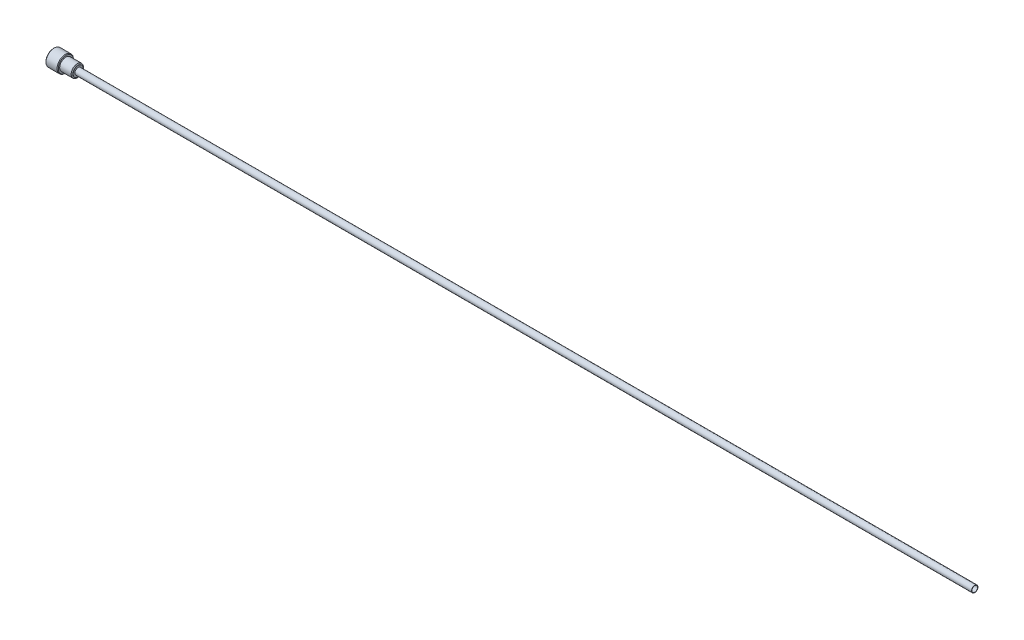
ISO-10303-21;
HEADER;
FILE_DESCRIPTION(('STEP AP214'),'2;1');
FILE_NAME('part.step','',(''),(''),'','','');
FILE_SCHEMA(('AUTOMOTIVE_DESIGN { 1 0 10303 214 1 1 1 1 }'));
ENDSEC;
DATA;
#1=APPLICATION_CONTEXT('core data for automotive mechanical design processes');
#2=APPLICATION_PROTOCOL_DEFINITION('international standard','automotive_design',2000,#1);
#3=PRODUCT_CONTEXT('',#1,'mechanical');
#4=PRODUCT('Part','Part','',(#3));
#5=PRODUCT_RELATED_PRODUCT_CATEGORY('part','',(#4));
#6=PRODUCT_DEFINITION_FORMATION('','',#4);
#7=PRODUCT_DEFINITION_CONTEXT('part definition',#1,'design');
#8=PRODUCT_DEFINITION('design','',#6,#7);
#9=PRODUCT_DEFINITION_SHAPE('','',#8);
#10=(LENGTH_UNIT() NAMED_UNIT(*) SI_UNIT(.MILLI.,.METRE.));
#11=(NAMED_UNIT(*) PLANE_ANGLE_UNIT() SI_UNIT($,.RADIAN.));
#12=(NAMED_UNIT(*) SI_UNIT($,.STERADIAN.) SOLID_ANGLE_UNIT());
#13=UNCERTAINTY_MEASURE_WITH_UNIT(LENGTH_MEASURE(1.E-05),#10,'distance_accuracy_value','');
#14=(GEOMETRIC_REPRESENTATION_CONTEXT(3) GLOBAL_UNCERTAINTY_ASSIGNED_CONTEXT((#13)) GLOBAL_UNIT_ASSIGNED_CONTEXT((#10,
#11,#12)) REPRESENTATION_CONTEXT('',''));
#15=CARTESIAN_POINT('',(0.,0.,0.));
#16=DIRECTION('',(0.,0.,1.));
#17=DIRECTION('',(1.,0.,0.));
#18=AXIS2_PLACEMENT_3D('',#15,#16,#17);
#19=CARTESIAN_POINT('',(12.,2.44,0.));
#20=DIRECTION('',(-1.,0.,0.));
#21=DIRECTION('',(0.,0.,1.));
#22=AXIS2_PLACEMENT_3D('',#19,#20,#21);
#23=PLANE('',#22);
#24=CARTESIAN_POINT('',(12.,0.,0.));
#25=DIRECTION('',(-1.,0.,0.));
#26=DIRECTION('',(0.,0.,1.));
#27=AXIS2_PLACEMENT_3D('',#24,#25,#26);
#28=CIRCLE('',#27,2.44);
#29=CARTESIAN_POINT('',(12.,0.,2.44));
#30=VERTEX_POINT('',#29);
#31=EDGE_CURVE('E133',#30,#30,#28,.T.);
#32=ORIENTED_EDGE('',*,*,#31,.F.);
#33=EDGE_LOOP('',(#32));
#34=FACE_BOUND('',#33,.T.);
#35=CARTESIAN_POINT('',(12.,0.,0.));
#36=DIRECTION('',(-1.,0.,0.));
#37=DIRECTION('',(0.,0.,1.));
#38=AXIS2_PLACEMENT_3D('',#35,#36,#37);
#39=CIRCLE('',#38,1.5875);
#40=CARTESIAN_POINT('',(12.,0.,1.5875));
#41=VERTEX_POINT('',#40);
#42=EDGE_CURVE('E115',#41,#41,#39,.T.);
#43=ORIENTED_EDGE('',*,*,#42,.T.);
#44=EDGE_LOOP('',(#43));
#45=FACE_BOUND('',#44,.T.);
#46=ADVANCED_FACE('F33',(#34,#45),#23,.F.);
#47=CARTESIAN_POINT('',(-22.2121854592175,0.,0.));
#48=DIRECTION('',(-1.,0.,0.));
#49=DIRECTION('',(0.,0.,1.));
#50=AXIS2_PLACEMENT_3D('',#47,#48,#49);
#51=CYLINDRICAL_SURFACE('',#50,2.44);
#52=CARTESIAN_POINT('',(11.9,0.,0.));
#53=DIRECTION('',(-1.,0.,0.));
#54=DIRECTION('',(0.,0.,1.));
#55=AXIS2_PLACEMENT_3D('',#52,#53,#54);
#56=CIRCLE('',#55,2.44);
#57=CARTESIAN_POINT('',(11.9,0.,2.44));
#58=VERTEX_POINT('',#57);
#59=EDGE_CURVE('E130',#58,#58,#56,.T.);
#60=ORIENTED_EDGE('',*,*,#59,.F.);
#61=EDGE_LOOP('',(#60));
#62=FACE_BOUND('',#61,.T.);
#63=ORIENTED_EDGE('',*,*,#31,.T.);
#64=EDGE_LOOP('',(#63));
#65=FACE_BOUND('',#64,.T.);
#66=ADVANCED_FACE('F272',(#62,#65),#51,.T.);
#67=CARTESIAN_POINT('',(11.9,0.,0.));
#68=DIRECTION('',(-1.,0.,0.));
#69=DIRECTION('',(0.,0.,1.));
#70=AXIS2_PLACEMENT_3D('',#67,#68,#69);
#71=CONICAL_SURFACE('',#70,2.44,1.0471975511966);
#72=CARTESIAN_POINT('',(11.5766838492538,0.,0.));
#73=DIRECTION('',(-1.,0.,0.));
#74=DIRECTION('',(0.,0.,1.));
#75=AXIS2_PLACEMENT_3D('',#72,#73,#74);
#76=CIRCLE('',#75,3.);
#77=CARTESIAN_POINT('',(11.5766838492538,0.,3.));
#78=VERTEX_POINT('',#77);
#79=EDGE_CURVE('E127',#78,#78,#76,.T.);
#80=ORIENTED_EDGE('',*,*,#79,.F.);
#81=EDGE_LOOP('',(#80));
#82=FACE_BOUND('',#81,.T.);
#83=ORIENTED_EDGE('',*,*,#59,.T.);
#84=EDGE_LOOP('',(#83));
#85=FACE_BOUND('',#84,.T.);
#86=ADVANCED_FACE('F278',(#82,#85),#71,.T.);
#87=CARTESIAN_POINT('',(-22.2121854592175,0.,0.));
#88=DIRECTION('',(-1.,0.,0.));
#89=DIRECTION('',(0.,0.,1.));
#90=AXIS2_PLACEMENT_3D('',#87,#88,#89);
#91=CYLINDRICAL_SURFACE('',#90,3.);
#92=CARTESIAN_POINT('',(6.,0.,0.));
#93=DIRECTION('',(-1.,0.,0.));
#94=DIRECTION('',(0.,0.,1.));
#95=AXIS2_PLACEMENT_3D('',#92,#93,#94);
#96=CIRCLE('',#95,3.);
#97=CARTESIAN_POINT('',(6.,0.,3.));
#98=VERTEX_POINT('',#97);
#99=EDGE_CURVE('E124',#98,#98,#96,.T.);
#100=ORIENTED_EDGE('',*,*,#99,.F.);
#101=EDGE_LOOP('',(#100));
#102=FACE_BOUND('',#101,.T.);
#103=ORIENTED_EDGE('',*,*,#79,.T.);
#104=EDGE_LOOP('',(#103));
#105=FACE_BOUND('',#104,.T.);
#106=ADVANCED_FACE('F286',(#102,#105),#91,.T.);
#107=CARTESIAN_POINT('',(6.,3.,0.));
#108=DIRECTION('',(-1.,0.,0.));
#109=DIRECTION('',(0.,0.,1.));
#110=AXIS2_PLACEMENT_3D('',#107,#108,#109);
#111=PLANE('',#110);
#112=CARTESIAN_POINT('',(6.,0.,0.));
#113=DIRECTION('',(-1.,0.,0.));
#114=DIRECTION('',(0.,0.,1.));
#115=AXIS2_PLACEMENT_3D('',#112,#113,#114);
#116=CIRCLE('',#115,3.69999999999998);
#117=CARTESIAN_POINT('',(6.,0.,3.69999999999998));
#118=VERTEX_POINT('',#117);
#119=EDGE_CURVE('E142',#118,#118,#116,.F.);
#120=ORIENTED_EDGE('',*,*,#119,.T.);
#121=EDGE_LOOP('',(#120));
#122=FACE_BOUND('',#121,.T.);
#123=ORIENTED_EDGE('',*,*,#99,.T.);
#124=EDGE_LOOP('',(#123));
#125=FACE_BOUND('',#124,.T.);
#126=ADVANCED_FACE('F290',(#122,#125),#111,.F.);
#127=CARTESIAN_POINT('',(-22.2121854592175,0.,0.));
#128=DIRECTION('',(-1.,0.,0.));
#129=DIRECTION('',(0.,0.,1.));
#130=AXIS2_PLACEMENT_3D('',#127,#128,#129);
#131=CYLINDRICAL_SURFACE('',#130,4.);
#132=CARTESIAN_POINT('',(5.69999999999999,0.,0.));
#133=DIRECTION('',(-1.,0.,0.));
#134=DIRECTION('',(0.,0.,1.));
#135=AXIS2_PLACEMENT_3D('',#132,#133,#134);
#136=CIRCLE('',#135,4.);
#137=CARTESIAN_POINT('',(5.69999999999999,0.,4.));
#138=VERTEX_POINT('',#137);
#139=EDGE_CURVE('E139',#138,#138,#136,.T.);
#140=ORIENTED_EDGE('',*,*,#139,.T.);
#141=EDGE_LOOP('',(#140));
#142=FACE_BOUND('',#141,.T.);
#143=CARTESIAN_POINT('',(0.299999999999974,0.,0.));
#144=DIRECTION('',(1.,0.,0.));
#145=DIRECTION('',(0.,0.,-1.));
#146=AXIS2_PLACEMENT_3D('',#143,#144,#145);
#147=CIRCLE('',#146,4.);
#148=CARTESIAN_POINT('',(0.299999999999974,0.,-4.));
#149=VERTEX_POINT('',#148);
#150=EDGE_CURVE('E136',#149,#149,#147,.T.);
#151=ORIENTED_EDGE('',*,*,#150,.T.);
#152=EDGE_LOOP('',(#151));
#153=FACE_BOUND('',#152,.T.);
#154=ADVANCED_FACE('F258',(#142,#153),#131,.T.);
#155=CARTESIAN_POINT('',(0.,1.3843,0.));
#156=DIRECTION('',(1.,0.,0.));
#157=DIRECTION('',(0.,0.,-1.));
#158=AXIS2_PLACEMENT_3D('',#155,#156,#157);
#159=PLANE('',#158);
#160=CARTESIAN_POINT('',(0.,0.,0.));
#161=DIRECTION('',(1.,0.,0.));
#162=DIRECTION('',(0.,0.,-1.));
#163=AXIS2_PLACEMENT_3D('',#160,#161,#162);
#164=CIRCLE('',#163,3.);
#165=CARTESIAN_POINT('',(0.,0.,-3.));
#166=VERTEX_POINT('',#165);
#167=EDGE_CURVE('E148',#166,#166,#164,.T.);
#168=ORIENTED_EDGE('',*,*,#167,.T.);
#169=EDGE_LOOP('',(#168));
#170=FACE_BOUND('',#169,.T.);
#171=CARTESIAN_POINT('',(0.,0.,0.));
#172=DIRECTION('',(1.,0.,0.));
#173=DIRECTION('',(0.,0.,-1.));
#174=AXIS2_PLACEMENT_3D('',#171,#172,#173);
#175=CIRCLE('',#174,3.70000000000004);
#176=CARTESIAN_POINT('',(0.,0.,-3.70000000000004));
#177=VERTEX_POINT('',#176);
#178=EDGE_CURVE('E145',#177,#177,#175,.F.);
#179=ORIENTED_EDGE('',*,*,#178,.T.);
#180=EDGE_LOOP('',(#179));
#181=FACE_BOUND('',#180,.T.);
#182=ADVANCED_FACE('F254',(#170,#181),#159,.F.);
#183=CARTESIAN_POINT('',(-22.2121854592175,0.,0.));
#184=DIRECTION('',(-1.,0.,0.));
#185=DIRECTION('',(0.,0.,1.));
#186=AXIS2_PLACEMENT_3D('',#183,#184,#185);
#187=CYLINDRICAL_SURFACE('',#186,1.38430000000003);
#188=CARTESIAN_POINT('',(4.47038019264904,0.,0.));
#189=DIRECTION('',(-1.,0.,0.));
#190=DIRECTION('',(0.,0.,1.));
#191=AXIS2_PLACEMENT_3D('',#188,#189,#190);
#192=CIRCLE('',#191,1.38430000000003);
#193=CARTESIAN_POINT('',(4.47038019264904,0.,1.38430000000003));
#194=VERTEX_POINT('',#193);
#195=EDGE_CURVE('E114',#194,#194,#192,.T.);
#196=ORIENTED_EDGE('',*,*,#195,.T.);
#197=EDGE_LOOP('',(#196));
#198=FACE_BOUND('',#197,.T.);
#199=CARTESIAN_POINT('',(450.,0.,0.));
#200=DIRECTION('',(-1.,0.,0.));
#201=DIRECTION('',(0.,0.,1.));
#202=AXIS2_PLACEMENT_3D('',#199,#200,#201);
#203=CIRCLE('',#202,1.38430000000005);
#204=CARTESIAN_POINT('',(450.,0.,1.38430000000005));
#205=VERTEX_POINT('',#204);
#206=EDGE_CURVE('E121',#205,#205,#203,.T.);
#207=ORIENTED_EDGE('',*,*,#206,.F.);
#208=EDGE_LOOP('',(#207));
#209=FACE_BOUND('',#208,.T.);
#210=ADVANCED_FACE('F257',(#198,#209),#187,.F.);
#211=CARTESIAN_POINT('',(450.,1.5875,0.));
#212=DIRECTION('',(-1.,0.,0.));
#213=DIRECTION('',(0.,0.,1.));
#214=AXIS2_PLACEMENT_3D('',#211,#212,#213);
#215=PLANE('',#214);
#216=CARTESIAN_POINT('',(450.,0.,0.));
#217=DIRECTION('',(-1.,0.,0.));
#218=DIRECTION('',(0.,0.,1.));
#219=AXIS2_PLACEMENT_3D('',#216,#217,#218);
#220=CIRCLE('',#219,1.5875);
#221=CARTESIAN_POINT('',(450.,0.,1.5875));
#222=VERTEX_POINT('',#221);
#223=EDGE_CURVE('E118',#222,#222,#220,.T.);
#224=ORIENTED_EDGE('',*,*,#223,.F.);
#225=EDGE_LOOP('',(#224));
#226=FACE_BOUND('',#225,.T.);
#227=ORIENTED_EDGE('',*,*,#206,.T.);
#228=EDGE_LOOP('',(#227));
#229=FACE_BOUND('',#228,.T.);
#230=ADVANCED_FACE('F299',(#226,#229),#215,.F.);
#231=CARTESIAN_POINT('',(-22.2121854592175,0.,0.));
#232=DIRECTION('',(-1.,0.,0.));
#233=DIRECTION('',(0.,0.,1.));
#234=AXIS2_PLACEMENT_3D('',#231,#232,#233);
#235=CYLINDRICAL_SURFACE('',#234,1.5875);
#236=ORIENTED_EDGE('',*,*,#42,.F.);
#237=EDGE_LOOP('',(#236));
#238=FACE_BOUND('',#237,.T.);
#239=ORIENTED_EDGE('',*,*,#223,.T.);
#240=EDGE_LOOP('',(#239));
#241=FACE_BOUND('',#240,.T.);
#242=ADVANCED_FACE('F195',(#238,#241),#235,.T.);
#243=CARTESIAN_POINT('',(5.69999999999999,0.,0.));
#244=DIRECTION('',(-1.,0.,0.));
#245=DIRECTION('',(0.,0.,1.));
#246=AXIS2_PLACEMENT_3D('',#243,#244,#245);
#247=CONICAL_SURFACE('',#246,4.,0.785398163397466);
#248=ORIENTED_EDGE('',*,*,#119,.F.);
#249=EDGE_LOOP('',(#248));
#250=FACE_BOUND('',#249,.T.);
#251=ORIENTED_EDGE('',*,*,#139,.F.);
#252=EDGE_LOOP('',(#251));
#253=FACE_BOUND('',#252,.T.);
#254=ADVANCED_FACE('F263',(#250,#253),#247,.T.);
#255=CARTESIAN_POINT('',(0.,0.,0.));
#256=DIRECTION('',(1.,0.,0.));
#257=DIRECTION('',(0.,0.,-1.));
#258=AXIS2_PLACEMENT_3D('',#255,#256,#257);
#259=CONICAL_SURFACE('',#258,3.70000000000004,0.785398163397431);
#260=CARTESIAN_POINT('',(0.299999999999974,0.,-4.));
#261=CARTESIAN_POINT('',(0.296874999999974,0.,-3.996875));
#262=CARTESIAN_POINT('',(0.293749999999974,0.,-3.99375));
#263=CARTESIAN_POINT('',(0.287499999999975,0.,-3.9875));
#264=CARTESIAN_POINT('',(0.284374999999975,0.,-3.984375));
#265=CARTESIAN_POINT('',(0.278124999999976,0.,-3.978125));
#266=CARTESIAN_POINT('',(0.274999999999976,0.,-3.975));
#267=CARTESIAN_POINT('',(0.268749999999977,0.,-3.96875));
#268=CARTESIAN_POINT('',(0.265624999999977,0.,-3.965625));
#269=CARTESIAN_POINT('',(0.259374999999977,0.,-3.959375));
#270=CARTESIAN_POINT('',(0.256249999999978,0.,-3.95625000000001));
#271=CARTESIAN_POINT('',(0.249999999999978,0.,-3.95000000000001));
#272=CARTESIAN_POINT('',(0.246874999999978,0.,-3.94687500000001));
#273=CARTESIAN_POINT('',(0.240624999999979,0.,-3.94062500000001));
#274=CARTESIAN_POINT('',(0.237499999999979,0.,-3.93750000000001));
#275=CARTESIAN_POINT('',(0.23124999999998,0.,-3.93125000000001));
#276=CARTESIAN_POINT('',(0.22812499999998,0.,-3.92812500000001));
#277=CARTESIAN_POINT('',(0.221874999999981,0.,-3.92187500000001));
#278=CARTESIAN_POINT('',(0.218749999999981,0.,-3.91875000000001));
#279=CARTESIAN_POINT('',(0.212499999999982,0.,-3.91250000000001));
#280=CARTESIAN_POINT('',(0.209374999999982,0.,-3.90937500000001));
#281=CARTESIAN_POINT('',(0.203124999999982,0.,-3.90312500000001));
#282=CARTESIAN_POINT('',(0.199999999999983,0.,-3.90000000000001));
#283=CARTESIAN_POINT('',(0.193749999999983,0.,-3.89375000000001));
#284=CARTESIAN_POINT('',(0.190624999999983,0.,-3.89062500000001));
#285=CARTESIAN_POINT('',(0.184374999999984,0.,-3.88437500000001));
#286=CARTESIAN_POINT('',(0.181249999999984,0.,-3.88125000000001));
#287=CARTESIAN_POINT('',(0.174999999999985,0.,-3.87500000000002));
#288=CARTESIAN_POINT('',(0.171874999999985,0.,-3.87187500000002));
#289=CARTESIAN_POINT('',(0.165624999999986,0.,-3.86562500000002));
#290=CARTESIAN_POINT('',(0.162499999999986,0.,-3.86250000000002));
#291=CARTESIAN_POINT('',(0.156249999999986,0.,-3.85625000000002));
#292=CARTESIAN_POINT('',(0.153124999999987,0.,-3.85312500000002));
#293=CARTESIAN_POINT('',(0.146874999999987,0.,-3.84687500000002));
#294=CARTESIAN_POINT('',(0.143749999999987,0.,-3.84375000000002));
#295=CARTESIAN_POINT('',(0.137499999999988,0.,-3.83750000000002));
#296=CARTESIAN_POINT('',(0.134374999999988,0.,-3.83437500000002));
#297=CARTESIAN_POINT('',(0.128124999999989,0.,-3.82812500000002));
#298=CARTESIAN_POINT('',(0.124999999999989,0.,-3.82500000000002));
#299=CARTESIAN_POINT('',(0.11874999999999,0.,-3.81875000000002));
#300=CARTESIAN_POINT('',(0.11562499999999,0.,-3.81562500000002));
#301=CARTESIAN_POINT('',(0.10937499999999,0.,-3.80937500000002));
#302=CARTESIAN_POINT('',(0.106249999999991,0.,-3.80625000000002));
#303=CARTESIAN_POINT('',(0.0999999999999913,0.,-3.80000000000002));
#304=CARTESIAN_POINT('',(0.0968749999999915,0.,-3.79687500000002));
#305=CARTESIAN_POINT('',(0.090624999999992,0.,-3.79062500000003));
#306=CARTESIAN_POINT('',(0.0874999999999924,0.,-3.78750000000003));
#307=CARTESIAN_POINT('',(0.0812499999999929,0.,-3.78125000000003));
#308=CARTESIAN_POINT('',(0.0781249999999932,0.,-3.77812500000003));
#309=CARTESIAN_POINT('',(0.0718749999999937,0.,-3.77187500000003));
#310=CARTESIAN_POINT('',(0.068749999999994,0.,-3.76875000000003));
#311=CARTESIAN_POINT('',(0.0624999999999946,0.,-3.76250000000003));
#312=CARTESIAN_POINT('',(0.0593749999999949,0.,-3.75937500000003));
#313=CARTESIAN_POINT('',(0.0531249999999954,0.,-3.75312500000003));
#314=CARTESIAN_POINT('',(0.0499999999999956,0.,-3.75000000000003));
#315=CARTESIAN_POINT('',(0.0437499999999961,0.,-3.74375000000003));
#316=CARTESIAN_POINT('',(0.0406249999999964,0.,-3.74062500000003));
#317=CARTESIAN_POINT('',(0.034374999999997,0.,-3.73437500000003));
#318=CARTESIAN_POINT('',(0.0312499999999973,0.,-3.73125000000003));
#319=CARTESIAN_POINT('',(0.0249999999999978,0.,-3.72500000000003));
#320=CARTESIAN_POINT('',(0.0218749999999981,0.,-3.72187500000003));
#321=CARTESIAN_POINT('',(0.0156249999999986,0.,-3.71562500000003));
#322=CARTESIAN_POINT('',(0.0124999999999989,0.,-3.71250000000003));
#323=CARTESIAN_POINT('',(0.00624999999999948,0.,-3.70625000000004));
#324=CARTESIAN_POINT('',(0.00312499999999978,0.,-3.70312500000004));
#325=CARTESIAN_POINT('',(0.,0.,-3.70000000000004));
#326=B_SPLINE_CURVE_WITH_KNOTS('',3,(#260,#261,#262,#263,#264,#265,#266,#267,#268,#269,#270,
#271,#272,#273,#274,#275,#276,#277,#278,#279,#280,#281,#282,#283,#284,#285,#286,#287,#288,#289,
#290,#291,#292,#293,#294,#295,#296,#297,#298,#299,#300,#301,#302,#303,#304,#305,#306,#307,#308,
#309,#310,#311,#312,#313,#314,#315,#316,#317,#318,#319,#320,#321,#322,#323,#324,#325),
.UNSPECIFIED.,.F.,.F.,(4,2,2,2,2,2,2,2,2,2,2,2,2,2,2,2,2,2,2,2,2,2,2,2,2,2,2,2,2,2,2,2,4),(0.,
0.0132582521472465,0.0265165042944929,0.0397747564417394,0.0530330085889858,0.0662912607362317,
0.0795495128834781,0.0928077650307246,0.106066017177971,0.119324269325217,0.132582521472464,
0.14584077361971,0.159099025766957,0.172357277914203,0.185615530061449,0.198873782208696,
0.212132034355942,0.225390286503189,0.238648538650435,0.251906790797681,0.265165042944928,
0.278423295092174,0.29168154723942,0.304939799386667,0.318198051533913,0.33145630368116,
0.344714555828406,0.357972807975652,0.371231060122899,0.384489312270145,0.397747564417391,
0.411005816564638,0.424264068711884),.UNSPECIFIED.);
#327=EDGE_CURVE('BSEAM192',#149,#177,#326,.T.);
#328=ORIENTED_EDGE('',*,*,#150,.F.);
#329=ORIENTED_EDGE('',*,*,#178,.F.);
#330=ORIENTED_EDGE('',*,*,#327,.T.);
#331=ORIENTED_EDGE('',*,*,#327,.F.);
#332=EDGE_LOOP('',(#328,#330,#329,#331));
#333=FACE_BOUND('',#332,.T.);
#334=ADVANCED_FACE('F192',(#333),#259,.T.);
#335=CARTESIAN_POINT('',(5.30215154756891,0.,0.));
#336=DIRECTION('',(-1.,0.,0.));
#337=DIRECTION('',(0.,0.,1.));
#338=AXIS2_PLACEMENT_3D('',#335,#336,#337);
#339=CONICAL_SURFACE('',#338,0.,1.02974425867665);
#340=CARTESIAN_POINT('',(3.56754696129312,-0.000199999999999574,2.88686681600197));
#341=CARTESIAN_POINT('',(3.60581197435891,0.110061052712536,2.82320756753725));
#342=CARTESIAN_POINT('',(3.64062862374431,0.221353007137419,2.75895312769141));
#343=CARTESIAN_POINT('',(3.70138455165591,0.446031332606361,2.62923503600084));
#344=CARTESIAN_POINT('',(3.72730005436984,0.559422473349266,2.5637686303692));
#345=CARTESIAN_POINT('',(3.76750158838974,0.784681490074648,2.43371527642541));
#346=CARTESIAN_POINT('',(3.78208098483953,0.896508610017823,2.36915185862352));
#347=CARTESIAN_POINT('',(3.79930451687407,1.12072036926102,2.23970313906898));
#348=CARTESIAN_POINT('',(3.80196486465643,1.23310404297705,2.17481839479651));
#349=CARTESIAN_POINT('',(3.79559529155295,1.44210106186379,2.05415390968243));
#350=CARTESIAN_POINT('',(3.78812589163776,1.53875335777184,1.99835168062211));
#351=CARTESIAN_POINT('',(3.76472839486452,1.73137309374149,1.8871426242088));
#352=CARTESIAN_POINT('',(3.74879176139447,1.8273397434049,1.83173625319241));
#353=CARTESIAN_POINT('',(3.70905591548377,2.02037775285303,1.7202857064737));
#354=CARTESIAN_POINT('',(3.685078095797,2.1174207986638,1.66425787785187));
#355=CARTESIAN_POINT('',(3.63075390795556,2.30995121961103,1.55310038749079));
#356=CARTESIAN_POINT('',(3.60042128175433,2.40544148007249,1.49796905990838));
#357=CARTESIAN_POINT('',(3.56754696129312,2.5002,1.44326020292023));
#358=B_SPLINE_CURVE_WITH_KNOTS('',3,(#340,#341,#342,#343,#344,#345,#346,#347,#348,#349,#350,
#351,#352,#353,#354,#355,#356,#357),.UNSPECIFIED.,.F.,.F.,(4,2,2,2,2,2,2,2,4),(0.,
0.399009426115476,0.799076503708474,1.18840971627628,1.57721319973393,1.91243534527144,
2.247996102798,2.59156706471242,2.93440260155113),.UNSPECIFIED.);
#359=CARTESIAN_POINT('',(3.56761634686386,0.,2.88675134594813));
#360=VERTEX_POINT('',#359);
#361=CARTESIAN_POINT('',(3.56761634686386,2.5,1.44337567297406));
#362=VERTEX_POINT('',#361);
#363=EDGE_CURVE('E184',#360,#362,#358,.T.);
#364=ORIENTED_EDGE('',*,*,#363,.T.);
#365=CARTESIAN_POINT('',(2.50121833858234,2.5,-3.93445228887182));
#366=CARTESIAN_POINT('',(2.55662981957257,2.5,-3.82516095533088));
#367=CARTESIAN_POINT('',(2.61153709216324,2.5,-3.71560968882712));
#368=CARTESIAN_POINT('',(2.72005982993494,2.5,-3.49584856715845));
#369=CARTESIAN_POINT('',(2.77367509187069,2.5,-3.38563861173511));
#370=CARTESIAN_POINT('',(2.87960556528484,2.5,-3.16384272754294));
#371=CARTESIAN_POINT('',(2.9319119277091,2.5,-3.05225255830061));
#372=CARTESIAN_POINT('',(3.03449790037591,2.5,-2.8281480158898));
#373=CARTESIAN_POINT('',(3.0847776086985,2.5,-2.71563368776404));
#374=CARTESIAN_POINT('',(3.18454161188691,2.5,-2.48540641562));
#375=CARTESIAN_POINT('',(3.23393168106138,2.5,-2.36765242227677));
#376=CARTESIAN_POINT('',(3.32916091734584,2.5,-2.13069065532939));
#377=CARTESIAN_POINT('',(3.37499965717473,2.5,-2.01148270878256));
#378=CARTESIAN_POINT('',(3.46195637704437,2.5,-1.77162143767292));
#379=CARTESIAN_POINT('',(3.50308398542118,2.5,-1.6509716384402));
#380=CARTESIAN_POINT('',(3.57932921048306,2.5,-1.40780534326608));
#381=CARTESIAN_POINT('',(3.61444881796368,2.5,-1.28528948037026));
#382=CARTESIAN_POINT('',(3.6768184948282,2.5,-1.03897034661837));
#383=CARTESIAN_POINT('',(3.70411186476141,2.5,-0.915178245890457));
#384=CARTESIAN_POINT('',(3.74926940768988,2.5,-0.665862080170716));
#385=CARTESIAN_POINT('',(3.76713504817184,2.5,-0.540338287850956));
#386=CARTESIAN_POINT('',(3.79171739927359,2.5,-0.29002538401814));
#387=CARTESIAN_POINT('',(3.79859299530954,2.5,-0.165252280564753));
#388=CARTESIAN_POINT('',(3.80101447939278,2.5,0.0844244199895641));
#389=CARTESIAN_POINT('',(3.79655969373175,2.5,0.209328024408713));
#390=CARTESIAN_POINT('',(3.78019947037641,2.5,0.415223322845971));
#391=CARTESIAN_POINT('',(3.77139929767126,2.5,0.496479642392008));
#392=CARTESIAN_POINT('',(3.74950026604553,2.5,0.658415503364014));
#393=CARTESIAN_POINT('',(3.73640087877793,2.5,0.739094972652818));
#394=CARTESIAN_POINT('',(3.69128706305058,2.5,0.980159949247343));
#395=CARTESIAN_POINT('',(3.65346576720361,2.5,1.13947362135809));
#396=CARTESIAN_POINT('',(3.58748317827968,2.5,1.3779296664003));
#397=CARTESIAN_POINT('',(3.5635904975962,2.5,1.45832293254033));
#398=CARTESIAN_POINT('',(3.51322918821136,2.5,1.61825518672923));
#399=CARTESIAN_POINT('',(3.48676203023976,2.5,1.69779463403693));
#400=CARTESIAN_POINT('',(3.43165273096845,2.5,1.85610877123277));
#401=CARTESIAN_POINT('',(3.40301061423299,2.5,1.93488346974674));
#402=CARTESIAN_POINT('',(3.34389013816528,2.5,2.09174976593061));
#403=CARTESIAN_POINT('',(3.31341154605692,2.5,2.16984127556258));
#404=CARTESIAN_POINT('',(3.20920954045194,2.5,2.42925934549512));
#405=CARTESIAN_POINT('',(3.13207809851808,2.5,2.6092167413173));
#406=CARTESIAN_POINT('',(2.97218403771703,2.5,2.96662413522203));
#407=CARTESIAN_POINT('',(2.88942004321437,2.5,3.14407350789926));
#408=CARTESIAN_POINT('',(2.71991284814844,2.5,3.49719205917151));
#409=CARTESIAN_POINT('',(2.63316716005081,2.5,3.67286003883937));
#410=CARTESIAN_POINT('',(2.45685769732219,2.5,4.02277753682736));
#411=CARTESIAN_POINT('',(2.36729381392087,2.5,4.19702700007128));
#412=CARTESIAN_POINT('',(2.18585533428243,2.5,4.54489735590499));
#413=CARTESIAN_POINT('',(2.09397529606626,2.5,4.71851540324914));
#414=CARTESIAN_POINT('',(1.90863794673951,2.5,5.06491042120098));
#415=CARTESIAN_POINT('',(1.81518060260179,2.5,5.23768737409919));
#416=CARTESIAN_POINT('',(1.53309046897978,2.5,5.75488997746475));
#417=CARTESIAN_POINT('',(1.34266159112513,2.5,6.09833521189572));
#418=CARTESIAN_POINT('',(0.987204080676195,2.5,6.73288419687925));
#419=CARTESIAN_POINT('',(0.822583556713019,2.5,7.02421772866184));
#420=CARTESIAN_POINT('',(0.491775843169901,2.5,7.60604061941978));
#421=CARTESIAN_POINT('',(0.325588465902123,2.5,7.89652987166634));
#422=CARTESIAN_POINT('',(-0.00709374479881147,2.5,8.47544823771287));
#423=CARTESIAN_POINT('',(-0.173583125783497,2.5,8.76388048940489));
#424=CARTESIAN_POINT('',(-0.507392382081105,2.5,9.34021231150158));
#425=CARTESIAN_POINT('',(-0.674712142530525,2.5,9.62811194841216));
#426=CARTESIAN_POINT('',(-0.842329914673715,2.5,9.91583709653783));
#427=B_SPLINE_CURVE_WITH_KNOTS('',3,(#365,#366,#367,#368,#369,#370,#371,#372,#373,#374,#375,
#376,#377,#378,#379,#380,#381,#382,#383,#384,#385,#386,#387,#388,#389,#390,#391,#392,#393,#394,
#395,#396,#397,#398,#399,#400,#401,#402,#403,#404,#405,#406,#407,#408,#409,#410,#411,#412,#413,
#414,#415,#416,#417,#418,#419,#420,#421,#422,#423,#424,#425,#426),.UNSPECIFIED.,.F.,.F.,(4,2,2,
2,2,2,2,2,2,2,2,2,2,2,2,2,2,2,2,2,2,2,2,2,2,2,2,2,2,2,4),(0.,0.367611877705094,
0.735281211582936,1.10498767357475,1.47467622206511,1.85770937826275,2.24078854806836,
2.62307028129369,3.00522509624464,3.38522284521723,3.765161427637,4.13955579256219,
4.51397241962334,4.75905314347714,5.00416399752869,5.49468074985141,5.74626180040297,
5.99769996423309,6.24913528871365,6.50060255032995,7.087805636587,7.67515265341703,
8.26287174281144,8.85061354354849,9.43989609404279,10.0291909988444,11.2072794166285,
12.2111557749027,13.2151539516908,14.2142555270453,15.2132225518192),.UNSPECIFIED.);
#428=CARTESIAN_POINT('',(3.56761634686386,2.5,-1.44337567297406));
#429=VERTEX_POINT('',#428);
#430=EDGE_CURVE('E93',#362,#429,#427,.F.);
#431=ORIENTED_EDGE('',*,*,#430,.T.);
#432=CARTESIAN_POINT('',(3.56754696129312,2.5002,-1.44326020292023));
#433=CARTESIAN_POINT('',(3.60581197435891,2.38993894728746,-1.50691945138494));
#434=CARTESIAN_POINT('',(3.64062862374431,2.27864699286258,-1.57117389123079));
#435=CARTESIAN_POINT('',(3.70138455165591,2.05396866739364,-1.70089198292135));
#436=CARTESIAN_POINT('',(3.72730005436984,1.94057752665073,-1.76635838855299));
#437=CARTESIAN_POINT('',(3.76750158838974,1.71531850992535,-1.89641174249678));
#438=CARTESIAN_POINT('',(3.78208098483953,1.60349138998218,-1.96097516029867));
#439=CARTESIAN_POINT('',(3.79930451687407,1.37927963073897,-2.09042387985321));
#440=CARTESIAN_POINT('',(3.80196486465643,1.26689595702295,-2.15530862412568));
#441=CARTESIAN_POINT('',(3.79559529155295,1.05789893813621,-2.27597310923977));
#442=CARTESIAN_POINT('',(3.78812589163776,0.961246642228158,-2.33177533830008));
#443=CARTESIAN_POINT('',(3.76472839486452,0.768626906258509,-2.44298439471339));
#444=CARTESIAN_POINT('',(3.74879176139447,0.672660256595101,-2.49839076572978));
#445=CARTESIAN_POINT('',(3.70905591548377,0.479622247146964,-2.60984131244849));
#446=CARTESIAN_POINT('',(3.685078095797,0.382579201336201,-2.66586914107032));
#447=CARTESIAN_POINT('',(3.63075390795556,0.190048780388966,-2.7770266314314));
#448=CARTESIAN_POINT('',(3.60042128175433,0.0945585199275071,-2.83215795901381));
#449=CARTESIAN_POINT('',(3.56754696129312,-0.000200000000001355,-2.88686681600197));
#450=B_SPLINE_CURVE_WITH_KNOTS('',3,(#432,#433,#434,#435,#436,#437,#438,#439,#440,#441,#442,
#443,#444,#445,#446,#447,#448,#449),.UNSPECIFIED.,.F.,.F.,(4,2,2,2,2,2,2,2,4),(0.,
0.399009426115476,0.799076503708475,1.18840971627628,1.57721319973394,1.91243534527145,
2.247996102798,2.59156706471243,2.93440260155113),.UNSPECIFIED.);
#451=CARTESIAN_POINT('',(3.56761634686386,0.,-2.88675134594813));
#452=VERTEX_POINT('',#451);
#453=EDGE_CURVE('E86',#429,#452,#450,.T.);
#454=ORIENTED_EDGE('',*,*,#453,.T.);
#455=CARTESIAN_POINT('',(3.56754696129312,0.000199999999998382,-2.88686681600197));
#456=CARTESIAN_POINT('',(3.60581197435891,-0.110061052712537,-2.82320756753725));
#457=CARTESIAN_POINT('',(3.64062862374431,-0.221353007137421,-2.75895312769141));
#458=CARTESIAN_POINT('',(3.70138455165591,-0.446031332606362,-2.62923503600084));
#459=CARTESIAN_POINT('',(3.72730005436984,-0.559422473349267,-2.5637686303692));
#460=CARTESIAN_POINT('',(3.76750158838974,-0.784681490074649,-2.43371527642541));
#461=CARTESIAN_POINT('',(3.78208098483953,-0.896508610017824,-2.36915185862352));
#462=CARTESIAN_POINT('',(3.79930451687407,-1.12072036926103,-2.23970313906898));
#463=CARTESIAN_POINT('',(3.80196486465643,-1.23310404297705,-2.17481839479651));
#464=CARTESIAN_POINT('',(3.79559529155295,-1.44210106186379,-2.05415390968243));
#465=CARTESIAN_POINT('',(3.78812589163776,-1.53875335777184,-1.99835168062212));
#466=CARTESIAN_POINT('',(3.76472839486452,-1.73137309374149,-1.8871426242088));
#467=CARTESIAN_POINT('',(3.74879176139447,-1.8273397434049,-1.83173625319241));
#468=CARTESIAN_POINT('',(3.70905591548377,-2.02037775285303,-1.7202857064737));
#469=CARTESIAN_POINT('',(3.685078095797,-2.1174207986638,-1.66425787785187));
#470=CARTESIAN_POINT('',(3.63075390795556,-2.30995121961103,-1.55310038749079));
#471=CARTESIAN_POINT('',(3.60042128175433,-2.40544148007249,-1.49796905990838));
#472=CARTESIAN_POINT('',(3.56754696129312,-2.5002,-1.44326020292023));
#473=B_SPLINE_CURVE_WITH_KNOTS('',3,(#455,#456,#457,#458,#459,#460,#461,#462,#463,#464,#465,
#466,#467,#468,#469,#470,#471,#472),.UNSPECIFIED.,.F.,.F.,(4,2,2,2,2,2,2,2,4),(0.,
0.399009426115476,0.799076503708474,1.18840971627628,1.57721319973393,1.91243534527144,
2.247996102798,2.59156706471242,2.93440260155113),.UNSPECIFIED.);
#474=CARTESIAN_POINT('',(3.56761634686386,-2.5,-1.44337567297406));
#475=VERTEX_POINT('',#474);
#476=EDGE_CURVE('E90',#452,#475,#473,.T.);
#477=ORIENTED_EDGE('',*,*,#476,.T.);
#478=CARTESIAN_POINT('',(2.50121833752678,-2.5,-3.9344522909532));
#479=CARTESIAN_POINT('',(2.5566298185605,-2.5,-3.82516095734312));
#480=CARTESIAN_POINT('',(2.61153709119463,-2.5,-3.71560969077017));
#481=CARTESIAN_POINT('',(2.72005982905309,-2.5,-3.49584856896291));
#482=CARTESIAN_POINT('',(2.77367509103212,-2.5,-3.38563861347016));
#483=CARTESIAN_POINT('',(2.87960556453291,-2.5,-3.16384272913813));
#484=CARTESIAN_POINT('',(2.93191192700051,-2.5,-3.05225255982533));
#485=CARTESIAN_POINT('',(3.03449789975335,-2.5,-2.82814801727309));
#486=CARTESIAN_POINT('',(3.08477760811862,-2.5,-2.71563368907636));
#487=CARTESIAN_POINT('',(3.18454161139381,-2.5,-2.48540641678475));
#488=CARTESIAN_POINT('',(3.23393168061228,-2.5,-2.36765242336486));
#489=CARTESIAN_POINT('',(3.32916091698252,-2.5,-2.13069065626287));
#490=CARTESIAN_POINT('',(3.37499965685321,-2.5,-2.01148270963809));
#491=CARTESIAN_POINT('',(3.46195637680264,-2.5,-1.77162143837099));
#492=CARTESIAN_POINT('',(3.50308398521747,-2.5,-1.65097163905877));
#493=CARTESIAN_POINT('',(3.57932921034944,-2.5,-1.40780534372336));
#494=CARTESIAN_POINT('',(3.61444881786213,-2.5,-1.28528948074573));
#495=CARTESIAN_POINT('',(3.67681849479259,-2.5,-1.03897034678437));
#496=CARTESIAN_POINT('',(3.70411186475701,-2.5,-0.915178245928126));
#497=CARTESIAN_POINT('',(3.74926940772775,-2.5,-0.665862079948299));
#498=CARTESIAN_POINT('',(3.76713504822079,-2.5,-0.540338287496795));
#499=CARTESIAN_POINT('',(3.79171739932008,-2.5,-0.290025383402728));
#500=CARTESIAN_POINT('',(3.79859299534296,-2.5,-0.165252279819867));
#501=CARTESIAN_POINT('',(3.80101447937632,-2.5,0.0844244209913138));
#502=CARTESIAN_POINT('',(3.79655969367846,-2.5,0.209328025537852));
#503=CARTESIAN_POINT('',(3.78019947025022,-2.5,0.415223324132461));
#504=CARTESIAN_POINT('',(3.77139929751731,-2.5,0.496479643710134));
#505=CARTESIAN_POINT('',(3.74950026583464,-2.5,0.658415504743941));
#506=CARTESIAN_POINT('',(3.73640087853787,-2.5,0.739094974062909));
#507=CARTESIAN_POINT('',(3.69128706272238,-2.5,0.980159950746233));
#508=CARTESIAN_POINT('',(3.65346576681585,-2.5,1.13947362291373));
#509=CARTESIAN_POINT('',(3.58748317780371,-2.5,1.37792966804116));
#510=CARTESIAN_POINT('',(3.56359049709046,-2.5,1.4583229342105));
#511=CARTESIAN_POINT('',(3.51322918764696,-2.5,1.61825518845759));
#512=CARTESIAN_POINT('',(3.48676202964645,-2.5,1.69779463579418));
#513=CARTESIAN_POINT('',(3.43165273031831,-2.5,1.85610877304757));
#514=CARTESIAN_POINT('',(3.40301061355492,-2.5,1.93488347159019));
#515=CARTESIAN_POINT('',(3.34389013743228,-2.5,2.09174976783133));
#516=CARTESIAN_POINT('',(3.31341154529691,-2.5,2.16984127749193));
#517=CARTESIAN_POINT('',(3.2092095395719,-2.5,2.42925934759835));
#518=CARTESIAN_POINT('',(3.1320780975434,-2.5,2.60921674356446));
#519=CARTESIAN_POINT('',(2.9721840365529,-2.5,2.96662413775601));
#520=CARTESIAN_POINT('',(2.88942004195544,-2.5,3.14407351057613));
#521=CARTESIAN_POINT('',(2.71991284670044,-2.5,3.49719206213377));
#522=CARTESIAN_POINT('',(2.63316715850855,-2.5,3.67286004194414));
#523=CARTESIAN_POINT('',(2.45685769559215,-2.5,4.02277754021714));
#524=CARTESIAN_POINT('',(2.36729381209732,-2.5,4.19702700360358));
#525=CARTESIAN_POINT('',(2.18585533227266,-2.5,4.54489735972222));
#526=CARTESIAN_POINT('',(2.0939752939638,-2.5,4.71851540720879));
#527=CARTESIAN_POINT('',(1.90863794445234,-2.5,5.06491042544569));
#528=CARTESIAN_POINT('',(1.8151806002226,-2.5,5.23768737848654));
#529=CARTESIAN_POINT('',(1.5330904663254,-2.5,5.75488998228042));
#530=CARTESIAN_POINT('',(1.34266158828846,-2.5,6.09833521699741));
#531=CARTESIAN_POINT('',(0.98720407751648,-2.5,6.73288420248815));
#532=CARTESIAN_POINT('',(0.822583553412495,-2.5,7.02421773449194));
#533=CARTESIAN_POINT('',(0.491775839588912,-2.5,7.60604062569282));
#534=CARTESIAN_POINT('',(0.325588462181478,-2.5,7.89652987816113));
#535=CARTESIAN_POINT('',(-0.00709374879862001,-2.5,8.47544824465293));
#536=CARTESIAN_POINT('',(-0.173583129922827,-2.5,8.76388049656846));
#537=CARTESIAN_POINT('',(-0.507392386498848,-2.5,9.34021231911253));
#538=CARTESIAN_POINT('',(-0.67471214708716,-2.5,9.62811195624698));
#539=CARTESIAN_POINT('',(-0.842329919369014,-2.5,9.91583710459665));
#540=B_SPLINE_CURVE_WITH_KNOTS('',3,(#478,#479,#480,#481,#482,#483,#484,#485,#486,#487,#488,
#489,#490,#491,#492,#493,#494,#495,#496,#497,#498,#499,#500,#501,#502,#503,#504,#505,#506,#507,
#508,#509,#510,#511,#512,#513,#514,#515,#516,#517,#518,#519,#520,#521,#522,#523,#524,#525,#526,
#527,#528,#529,#530,#531,#532,#533,#534,#535,#536,#537,#538,#539),.UNSPECIFIED.,.F.,.F.,(4,2,2,
2,2,2,2,2,2,2,2,2,2,2,2,2,2,2,2,2,2,2,2,2,2,2,2,2,2,2,4),(0.,0.36761187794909,0.735281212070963,
1.10498767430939,1.47467622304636,1.85770937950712,2.24078854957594,2.62307028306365,
3.00522509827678,3.3852228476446,3.76516143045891,4.13955579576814,4.5139724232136,
4.75905314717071,5.00416400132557,5.4946807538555,5.74626180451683,5.9976999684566,
6.24913529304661,6.5006025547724,7.08780564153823,7.67515265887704,8.26287174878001,
8.8506135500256,9.43989610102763,10.029191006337,11.2072794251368,12.2111557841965,
13.2151539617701,14.2142555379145,15.2132225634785),.UNSPECIFIED.);
#541=CARTESIAN_POINT('',(3.56761634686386,-2.5,1.44337567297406));
#542=VERTEX_POINT('',#541);
#543=EDGE_CURVE('E207',#475,#542,#540,.T.);
#544=ORIENTED_EDGE('',*,*,#543,.T.);
#545=CARTESIAN_POINT('',(3.56754696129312,-2.5002,1.44326020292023));
#546=CARTESIAN_POINT('',(3.60581197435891,-2.38993894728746,1.50691945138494));
#547=CARTESIAN_POINT('',(3.64062862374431,-2.27864699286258,1.57117389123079));
#548=CARTESIAN_POINT('',(3.70138455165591,-2.05396866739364,1.70089198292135));
#549=CARTESIAN_POINT('',(3.72730005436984,-1.94057752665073,1.76635838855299));
#550=CARTESIAN_POINT('',(3.76750158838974,-1.71531850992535,1.89641174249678));
#551=CARTESIAN_POINT('',(3.78208098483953,-1.60349138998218,1.96097516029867));
#552=CARTESIAN_POINT('',(3.79930451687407,-1.37927963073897,2.09042387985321));
#553=CARTESIAN_POINT('',(3.80196486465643,-1.26689595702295,2.15530862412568));
#554=CARTESIAN_POINT('',(3.79559529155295,-1.05789893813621,2.27597310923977));
#555=CARTESIAN_POINT('',(3.78812589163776,-0.961246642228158,2.33177533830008));
#556=CARTESIAN_POINT('',(3.76472839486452,-0.768626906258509,2.44298439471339));
#557=CARTESIAN_POINT('',(3.74879176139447,-0.672660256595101,2.49839076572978));
#558=CARTESIAN_POINT('',(3.70905591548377,-0.479622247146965,2.60984131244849));
#559=CARTESIAN_POINT('',(3.685078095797,-0.382579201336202,2.66586914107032));
#560=CARTESIAN_POINT('',(3.63075390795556,-0.190048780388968,2.7770266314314));
#561=CARTESIAN_POINT('',(3.60042128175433,-0.0945585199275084,2.83215795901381));
#562=CARTESIAN_POINT('',(3.56754696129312,0.000200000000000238,2.88686681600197));
#563=B_SPLINE_CURVE_WITH_KNOTS('',3,(#545,#546,#547,#548,#549,#550,#551,#552,#553,#554,#555,
#556,#557,#558,#559,#560,#561,#562),.UNSPECIFIED.,.F.,.F.,(4,2,2,2,2,2,2,2,4),(0.,
0.399009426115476,0.799076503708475,1.18840971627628,1.57721319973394,1.91243534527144,
2.247996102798,2.59156706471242,2.93440260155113),.UNSPECIFIED.);
#564=EDGE_CURVE('E202',#542,#360,#563,.T.);
#565=ORIENTED_EDGE('',*,*,#564,.T.);
#566=EDGE_LOOP('',(#364,#431,#454,#477,#544,#565));
#567=FACE_BOUND('',#566,.T.);
#568=ORIENTED_EDGE('',*,*,#195,.F.);
#569=EDGE_LOOP('',(#568));
#570=FACE_BOUND('',#569,.T.);
#571=ADVANCED_FACE('F88',(#567,#570),#339,.F.);
#572=CARTESIAN_POINT('',(0.,0.,0.));
#573=DIRECTION('',(-1.,0.,0.));
#574=DIRECTION('',(0.,0.,1.));
#575=AXIS2_PLACEMENT_3D('',#572,#573,#574);
#576=CONICAL_SURFACE('',#575,3.,0.785398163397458);
#577=CARTESIAN_POINT('',(0.113133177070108,2.5002,-1.44326020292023));
#578=CARTESIAN_POINT('',(0.162707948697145,2.41426172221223,-1.49287669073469));
#579=CARTESIAN_POINT('',(0.209371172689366,2.32688643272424,-1.5433228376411));
#580=CARTESIAN_POINT('',(0.29481051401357,2.14871854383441,-1.64618811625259));
#581=CARTESIAN_POINT('',(0.333539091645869,2.05790899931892,-1.6986170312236));
#582=CARTESIAN_POINT('',(0.399881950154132,1.87479587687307,-1.80433744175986));
#583=CARTESIAN_POINT('',(0.427662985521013,1.78253893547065,-1.85760201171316));
#584=CARTESIAN_POINT('',(0.470465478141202,1.5959939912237,-1.9653037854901));
#585=CARTESIAN_POINT('',(0.485518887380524,1.5017116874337,-2.01973769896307));
#586=CARTESIAN_POINT('',(0.499100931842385,1.33922174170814,-2.11355131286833));
#587=CARTESIAN_POINT('',(0.501111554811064,1.27122403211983,-2.15280980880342));
#588=CARTESIAN_POINT('',(0.497724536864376,1.13533975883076,-2.2312626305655));
#589=CARTESIAN_POINT('',(0.492324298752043,1.06745324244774,-2.27045692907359));
#590=CARTESIAN_POINT('',(0.47442286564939,0.93232121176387,-2.34847544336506));
#591=CARTESIAN_POINT('',(0.46191372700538,0.865076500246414,-2.38729919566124));
#592=CARTESIAN_POINT('',(0.430481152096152,0.731749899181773,-2.46427534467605));
#593=CARTESIAN_POINT('',(0.41155820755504,0.665667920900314,-2.50242779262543));
#594=CARTESIAN_POINT('',(0.355381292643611,0.49640365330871,-2.60015256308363));
#595=CARTESIAN_POINT('',(0.313892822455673,0.394270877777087,-2.6591189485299));
#596=CARTESIAN_POINT('',(0.243854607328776,0.244093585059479,-2.74582384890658));
#597=CARTESIAN_POINT('',(0.219246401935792,0.194603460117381,-2.77439698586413));
#598=CARTESIAN_POINT('',(0.167786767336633,0.0965399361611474,-2.83101398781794));
#599=CARTESIAN_POINT('',(0.140936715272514,0.0479659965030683,-2.85905816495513));
#600=CARTESIAN_POINT('',(0.113133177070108,-0.000200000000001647,-2.88686681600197));
#601=B_SPLINE_CURVE_WITH_KNOTS('',3,(#577,#578,#579,#580,#581,#582,#583,#584,#585,#586,#587,
#588,#589,#590,#591,#592,#593,#594,#595,#596,#597,#598,#599,#600),.UNSPECIFIED.,.F.,.F.,(4,2,2,
2,2,2,2,2,2,2,2,4),(0.,0.333012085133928,0.667964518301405,0.99759703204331,1.32639954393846,
1.56169424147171,1.79707142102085,2.03271213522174,2.26833478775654,2.64260240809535,
2.82922877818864,3.01574133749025),.UNSPECIFIED.);
#602=CARTESIAN_POINT('',(0.113248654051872,2.5,-1.44337567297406));
#603=VERTEX_POINT('',#602);
#604=CARTESIAN_POINT('',(0.113248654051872,0.,-2.88675134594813));
#605=VERTEX_POINT('',#604);
#606=EDGE_CURVE('E11',#603,#605,#601,.T.);
#607=ORIENTED_EDGE('',*,*,#606,.F.);
#608=CARTESIAN_POINT('',(-0.949948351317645,2.5,-3.05811902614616));
#609=CARTESIAN_POINT('',(-0.892894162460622,2.5,-2.98440983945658));
#610=CARTESIAN_POINT('',(-0.836338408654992,2.5,-2.91030875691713));
#611=CARTESIAN_POINT('',(-0.724452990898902,2.5,-2.76116077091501));
#612=CARTESIAN_POINT('',(-0.669123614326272,2.5,-2.68611365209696));
#613=CARTESIAN_POINT('',(-0.559526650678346,2.5,-2.53436379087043));
#614=CARTESIAN_POINT('',(-0.505270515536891,2.5,-2.45765275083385));
#615=CARTESIAN_POINT('',(-0.398602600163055,2.5,-2.30296317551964));
#616=CARTESIAN_POINT('',(-0.346190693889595,2.5,-2.2249847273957));
#617=CARTESIAN_POINT('',(-0.240263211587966,2.5,-2.06236769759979));
#618=CARTESIAN_POINT('',(-0.186901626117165,2.5,-1.97762830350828));
#619=CARTESIAN_POINT('',(-0.0834430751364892,2.5,-1.80618229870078));
#620=CARTESIAN_POINT('',(-0.0333456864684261,2.5,-1.71947594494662));
#621=CARTESIAN_POINT('',(0.0625474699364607,2.5,-1.54402392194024));
#622=CARTESIAN_POINT('',(0.108355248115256,2.5,-1.45528486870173));
#623=CARTESIAN_POINT('',(0.194634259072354,2.5,-1.27526975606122));
#624=CARTESIAN_POINT('',(0.235108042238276,2.5,-1.18399493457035));
#625=CARTESIAN_POINT('',(0.305371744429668,2.5,-1.00836471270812));
#626=CARTESIAN_POINT('',(0.335835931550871,2.5,-0.924281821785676));
#627=CARTESIAN_POINT('',(0.390037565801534,2.5,-0.753934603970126));
#628=CARTESIAN_POINT('',(0.413774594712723,2.5,-0.667670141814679));
#629=CARTESIAN_POINT('',(0.452824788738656,2.5,-0.495001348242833));
#630=CARTESIAN_POINT('',(0.468293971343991,2.5,-0.408632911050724));
#631=CARTESIAN_POINT('',(0.490478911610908,2.5,-0.234772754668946));
#632=CARTESIAN_POINT('',(0.497196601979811,2.5,-0.147281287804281));
#633=CARTESIAN_POINT('',(0.501281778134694,2.5,0.0238518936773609));
#634=CARTESIAN_POINT('',(0.49906913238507,2.5,0.107483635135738));
#635=CARTESIAN_POINT('',(0.486390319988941,2.5,0.274114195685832));
#636=CARTESIAN_POINT('',(0.475923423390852,2.5,0.357112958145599));
#637=CARTESIAN_POINT('',(0.447157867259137,2.5,0.523288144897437));
#638=CARTESIAN_POINT('',(0.428719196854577,2.5,0.606439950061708));
#639=CARTESIAN_POINT('',(0.38504379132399,2.5,0.770896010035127));
#640=CARTESIAN_POINT('',(0.359807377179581,2.5,0.852200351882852));
#641=CARTESIAN_POINT('',(0.272999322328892,2.5,1.10064624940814));
#642=CARTESIAN_POINT('',(0.20186624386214,2.5,1.26445670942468));
#643=CARTESIAN_POINT('',(0.0831798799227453,2.5,1.50421272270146));
#644=CARTESIAN_POINT('',(0.041528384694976,2.5,1.58328419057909));
#645=CARTESIAN_POINT('',(-0.0450124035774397,2.5,1.73963927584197));
#646=CARTESIAN_POINT('',(-0.089901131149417,2.5,1.81692320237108));
#647=CARTESIAN_POINT('',(-0.179991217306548,2.5,1.96613896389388));
#648=CARTESIAN_POINT('',(-0.225068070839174,2.5,2.0381468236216));
#649=CARTESIAN_POINT('',(-0.317147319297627,2.5,2.18092679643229));
#650=CARTESIAN_POINT('',(-0.364149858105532,2.5,2.2516988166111));
#651=CARTESIAN_POINT('',(-0.459355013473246,2.5,2.39159945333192));
#652=CARTESIAN_POINT('',(-0.507545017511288,2.5,2.46073668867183));
#653=CARTESIAN_POINT('',(-0.60522114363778,2.5,2.59806183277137));
#654=CARTESIAN_POINT('',(-0.654706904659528,2.5,2.66624999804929));
#655=CARTESIAN_POINT('',(-0.704723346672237,2.5,2.73404006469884));
#656=B_SPLINE_CURVE_WITH_KNOTS('',3,(#608,#609,#610,#611,#612,#613,#614,#615,#616,#617,#618,
#619,#620,#621,#622,#623,#624,#625,#626,#627,#628,#629,#630,#631,#632,#633,#634,#635,#636,#637,
#638,#639,#640,#641,#642,#643,#644,#645,#646,#647,#648,#649,#650,#651,#652,#653,#654,#655),
.UNSPECIFIED.,.F.,.F.,(4,2,2,2,2,2,2,2,2,2,2,2,2,2,2,2,2,2,2,2,2,2,2,4),(0.,0.279636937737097,
0.559338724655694,0.841193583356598,1.12302914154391,1.42339426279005,1.72372036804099,
2.02317874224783,2.32249341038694,2.59055815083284,2.85863955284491,3.12146553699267,
3.38423346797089,3.63479445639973,3.88537760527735,4.14055298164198,4.39571631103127,
4.92983151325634,5.19792074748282,5.46596326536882,5.72079181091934,5.97563943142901,
6.22844778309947,6.48118642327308),.UNSPECIFIED.);
#657=CARTESIAN_POINT('',(0.113248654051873,2.5,1.44337567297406));
#658=VERTEX_POINT('',#657);
#659=EDGE_CURVE('E153',#658,#603,#656,.F.);
#660=ORIENTED_EDGE('',*,*,#659,.F.);
#661=CARTESIAN_POINT('',(0.113133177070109,-0.000199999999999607,2.88686681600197));
#662=CARTESIAN_POINT('',(0.162707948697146,0.0857382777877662,2.83725032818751));
#663=CARTESIAN_POINT('',(0.209371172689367,0.173113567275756,2.78680418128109));
#664=CARTESIAN_POINT('',(0.294810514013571,0.351281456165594,2.6839389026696));
#665=CARTESIAN_POINT('',(0.333539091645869,0.442091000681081,2.63150998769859));
#666=CARTESIAN_POINT('',(0.399881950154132,0.625204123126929,2.52578957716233));
#667=CARTESIAN_POINT('',(0.427662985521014,0.717461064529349,2.47252500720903));
#668=CARTESIAN_POINT('',(0.470465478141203,0.904006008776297,2.36482323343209));
#669=CARTESIAN_POINT('',(0.485518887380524,0.998288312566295,2.31038931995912));
#670=CARTESIAN_POINT('',(0.499100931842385,1.16077825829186,2.21657570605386));
#671=CARTESIAN_POINT('',(0.501111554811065,1.22877596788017,2.17731721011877));
#672=CARTESIAN_POINT('',(0.497724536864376,1.36466024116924,2.09886438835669));
#673=CARTESIAN_POINT('',(0.492324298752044,1.43254675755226,2.05967008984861));
#674=CARTESIAN_POINT('',(0.474422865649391,1.56767878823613,1.98165157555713));
#675=CARTESIAN_POINT('',(0.461913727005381,1.63492349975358,1.94282782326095));
#676=CARTESIAN_POINT('',(0.430481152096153,1.76825010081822,1.86585167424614));
#677=CARTESIAN_POINT('',(0.41155820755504,1.83433207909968,1.82769922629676));
#678=CARTESIAN_POINT('',(0.355381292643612,2.00359634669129,1.72997445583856));
#679=CARTESIAN_POINT('',(0.313892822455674,2.10572912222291,1.6710080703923));
#680=CARTESIAN_POINT('',(0.243854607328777,2.25590641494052,1.58430317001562));
#681=CARTESIAN_POINT('',(0.219246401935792,2.30539653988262,1.55573003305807));
#682=CARTESIAN_POINT('',(0.167786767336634,2.40346006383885,1.49911303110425));
#683=CARTESIAN_POINT('',(0.140936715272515,2.45203400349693,1.47106885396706));
#684=CARTESIAN_POINT('',(0.113133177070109,2.5002,1.44326020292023));
#685=B_SPLINE_CURVE_WITH_KNOTS('',3,(#661,#662,#663,#664,#665,#666,#667,#668,#669,#670,#671,
#672,#673,#674,#675,#676,#677,#678,#679,#680,#681,#682,#683,#684),.UNSPECIFIED.,.F.,.F.,(4,2,2,
2,2,2,2,2,2,2,2,4),(0.,0.333012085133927,0.667964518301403,0.997597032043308,1.32639954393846,
1.5616942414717,1.79707142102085,2.03271213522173,2.26833478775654,2.64260240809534,
2.82922877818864,3.01574133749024),.UNSPECIFIED.);
#686=CARTESIAN_POINT('',(0.113248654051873,0.,2.88675134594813));
#687=VERTEX_POINT('',#686);
#688=EDGE_CURVE('E160',#687,#658,#685,.T.);
#689=ORIENTED_EDGE('',*,*,#688,.F.);
#690=CARTESIAN_POINT('',(0.113133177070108,-2.5002,1.44326020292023));
#691=CARTESIAN_POINT('',(0.162707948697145,-2.41426172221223,1.49287669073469));
#692=CARTESIAN_POINT('',(0.209371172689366,-2.32688643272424,1.5433228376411));
#693=CARTESIAN_POINT('',(0.29481051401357,-2.14871854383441,1.64618811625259));
#694=CARTESIAN_POINT('',(0.333539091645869,-2.05790899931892,1.6986170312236));
#695=CARTESIAN_POINT('',(0.399881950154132,-1.87479587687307,1.80433744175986));
#696=CARTESIAN_POINT('',(0.427662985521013,-1.78253893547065,1.85760201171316));
#697=CARTESIAN_POINT('',(0.470465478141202,-1.5959939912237,1.9653037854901));
#698=CARTESIAN_POINT('',(0.485518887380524,-1.5017116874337,2.01973769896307));
#699=CARTESIAN_POINT('',(0.499100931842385,-1.33922174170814,2.11355131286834));
#700=CARTESIAN_POINT('',(0.501111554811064,-1.27122403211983,2.15280980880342));
#701=CARTESIAN_POINT('',(0.497724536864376,-1.13533975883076,2.2312626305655));
#702=CARTESIAN_POINT('',(0.492324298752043,-1.06745324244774,2.27045692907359));
#703=CARTESIAN_POINT('',(0.47442286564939,-0.932321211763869,2.34847544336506));
#704=CARTESIAN_POINT('',(0.46191372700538,-0.865076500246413,2.38729919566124));
#705=CARTESIAN_POINT('',(0.430481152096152,-0.731749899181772,2.46427534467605));
#706=CARTESIAN_POINT('',(0.41155820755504,-0.665667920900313,2.50242779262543));
#707=CARTESIAN_POINT('',(0.355381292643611,-0.49640365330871,2.60015256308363));
#708=CARTESIAN_POINT('',(0.313892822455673,-0.394270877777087,2.6591189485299));
#709=CARTESIAN_POINT('',(0.243854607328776,-0.244093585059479,2.74582384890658));
#710=CARTESIAN_POINT('',(0.219246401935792,-0.194603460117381,2.77439698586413));
#711=CARTESIAN_POINT('',(0.167786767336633,-0.096539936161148,2.83101398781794));
#712=CARTESIAN_POINT('',(0.140936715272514,-0.0479659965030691,2.85905816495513));
#713=CARTESIAN_POINT('',(0.113133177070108,0.000200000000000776,2.88686681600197));
#714=B_SPLINE_CURVE_WITH_KNOTS('',3,(#690,#691,#692,#693,#694,#695,#696,#697,#698,#699,#700,
#701,#702,#703,#704,#705,#706,#707,#708,#709,#710,#711,#712,#713),.UNSPECIFIED.,.F.,.F.,(4,2,2,
2,2,2,2,2,2,2,2,4),(0.,0.333012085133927,0.667964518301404,0.997597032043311,1.32639954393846,
1.56169424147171,1.79707142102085,2.03271213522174,2.26833478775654,2.64260240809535,
2.82922877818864,3.01574133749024),.UNSPECIFIED.);
#715=CARTESIAN_POINT('',(0.113248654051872,-2.5,1.44337567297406));
#716=VERTEX_POINT('',#715);
#717=EDGE_CURVE('E229',#716,#687,#714,.T.);
#718=ORIENTED_EDGE('',*,*,#717,.F.);
#719=CARTESIAN_POINT('',(-0.949948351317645,-2.5,-3.05811902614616));
#720=CARTESIAN_POINT('',(-0.892894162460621,-2.5,-2.98440983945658));
#721=CARTESIAN_POINT('',(-0.836338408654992,-2.5,-2.91030875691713));
#722=CARTESIAN_POINT('',(-0.724452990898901,-2.5,-2.76116077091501));
#723=CARTESIAN_POINT('',(-0.669123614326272,-2.5,-2.68611365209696));
#724=CARTESIAN_POINT('',(-0.559526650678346,-2.5,-2.53436379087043));
#725=CARTESIAN_POINT('',(-0.505270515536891,-2.5,-2.45765275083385));
#726=CARTESIAN_POINT('',(-0.398602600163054,-2.5,-2.30296317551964));
#727=CARTESIAN_POINT('',(-0.346190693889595,-2.5,-2.2249847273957));
#728=CARTESIAN_POINT('',(-0.240263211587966,-2.5,-2.06236769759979));
#729=CARTESIAN_POINT('',(-0.186901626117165,-2.5,-1.97762830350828));
#730=CARTESIAN_POINT('',(-0.0834430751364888,-2.5,-1.80618229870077));
#731=CARTESIAN_POINT('',(-0.0333456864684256,-2.5,-1.71947594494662));
#732=CARTESIAN_POINT('',(0.0625474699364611,-2.5,-1.54402392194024));
#733=CARTESIAN_POINT('',(0.108355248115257,-2.5,-1.45528486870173));
#734=CARTESIAN_POINT('',(0.194634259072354,-2.5,-1.27526975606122));
#735=CARTESIAN_POINT('',(0.235108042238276,-2.5,-1.18399493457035));
#736=CARTESIAN_POINT('',(0.305371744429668,-2.5,-1.00836471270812));
#737=CARTESIAN_POINT('',(0.335835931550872,-2.5,-0.924281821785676));
#738=CARTESIAN_POINT('',(0.390037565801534,-2.5,-0.753934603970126));
#739=CARTESIAN_POINT('',(0.413774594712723,-2.5,-0.667670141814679));
#740=CARTESIAN_POINT('',(0.452824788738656,-2.5,-0.495001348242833));
#741=CARTESIAN_POINT('',(0.468293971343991,-2.5,-0.408632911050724));
#742=CARTESIAN_POINT('',(0.490478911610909,-2.5,-0.234772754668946));
#743=CARTESIAN_POINT('',(0.497196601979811,-2.5,-0.14728128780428));
#744=CARTESIAN_POINT('',(0.501281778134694,-2.5,0.0238518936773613));
#745=CARTESIAN_POINT('',(0.49906913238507,-2.5,0.107483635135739));
#746=CARTESIAN_POINT('',(0.486390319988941,-2.5,0.274114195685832));
#747=CARTESIAN_POINT('',(0.475923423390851,-2.5,0.357112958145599));
#748=CARTESIAN_POINT('',(0.447157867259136,-2.5,0.523288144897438));
#749=CARTESIAN_POINT('',(0.428719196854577,-2.5,0.606439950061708));
#750=CARTESIAN_POINT('',(0.38504379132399,-2.5,0.770896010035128));
#751=CARTESIAN_POINT('',(0.359807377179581,-2.5,0.852200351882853));
#752=CARTESIAN_POINT('',(0.272999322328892,-2.5,1.10064624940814));
#753=CARTESIAN_POINT('',(0.20186624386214,-2.5,1.26445670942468));
#754=CARTESIAN_POINT('',(0.0831798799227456,-2.5,1.50421272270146));
#755=CARTESIAN_POINT('',(0.0415283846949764,-2.5,1.58328419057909));
#756=CARTESIAN_POINT('',(-0.045012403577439,-2.5,1.73963927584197));
#757=CARTESIAN_POINT('',(-0.0899011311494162,-2.5,1.81692320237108));
#758=CARTESIAN_POINT('',(-0.179991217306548,-2.5,1.96613896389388));
#759=CARTESIAN_POINT('',(-0.225068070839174,-2.5,2.0381468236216));
#760=CARTESIAN_POINT('',(-0.317147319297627,-2.5,2.18092679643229));
#761=CARTESIAN_POINT('',(-0.364149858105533,-2.5,2.2516988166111));
#762=CARTESIAN_POINT('',(-0.459355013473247,-2.5,2.39159945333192));
#763=CARTESIAN_POINT('',(-0.507545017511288,-2.5,2.46073668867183));
#764=CARTESIAN_POINT('',(-0.605221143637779,-2.5,2.59806183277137));
#765=CARTESIAN_POINT('',(-0.654706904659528,-2.5,2.66624999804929));
#766=CARTESIAN_POINT('',(-0.704723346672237,-2.5,2.73404006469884));
#767=B_SPLINE_CURVE_WITH_KNOTS('',3,(#719,#720,#721,#722,#723,#724,#725,#726,#727,#728,#729,
#730,#731,#732,#733,#734,#735,#736,#737,#738,#739,#740,#741,#742,#743,#744,#745,#746,#747,#748,
#749,#750,#751,#752,#753,#754,#755,#756,#757,#758,#759,#760,#761,#762,#763,#764,#765,#766),
.UNSPECIFIED.,.F.,.F.,(4,2,2,2,2,2,2,2,2,2,2,2,2,2,2,2,2,2,2,2,2,2,2,4),(0.,0.279636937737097,
0.559338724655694,0.841193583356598,1.12302914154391,1.42339426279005,1.72372036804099,
2.02317874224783,2.32249341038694,2.59055815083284,2.85863955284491,3.12146553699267,
3.38423346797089,3.63479445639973,3.88537760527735,4.14055298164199,4.39571631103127,
4.92983151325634,5.19792074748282,5.46596326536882,5.72079181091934,5.97563943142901,
6.22844778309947,6.48118642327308),.UNSPECIFIED.);
#768=CARTESIAN_POINT('',(0.113248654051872,-2.5,-1.44337567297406));
#769=VERTEX_POINT('',#768);
#770=EDGE_CURVE('E56',#769,#716,#767,.T.);
#771=ORIENTED_EDGE('',*,*,#770,.F.);
#772=CARTESIAN_POINT('',(0.113133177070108,0.000199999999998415,-2.88686681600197));
#773=CARTESIAN_POINT('',(0.162707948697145,-0.0857382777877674,-2.83725032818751));
#774=CARTESIAN_POINT('',(0.209371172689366,-0.173113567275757,-2.78680418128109));
#775=CARTESIAN_POINT('',(0.29481051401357,-0.351281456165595,-2.6839389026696));
#776=CARTESIAN_POINT('',(0.333539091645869,-0.442091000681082,-2.6315099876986));
#777=CARTESIAN_POINT('',(0.399881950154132,-0.625204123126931,-2.52578957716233));
#778=CARTESIAN_POINT('',(0.427662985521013,-0.717461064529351,-2.47252500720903));
#779=CARTESIAN_POINT('',(0.470465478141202,-0.904006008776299,-2.36482323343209));
#780=CARTESIAN_POINT('',(0.485518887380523,-0.998288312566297,-2.31038931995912));
#781=CARTESIAN_POINT('',(0.499100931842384,-1.16077825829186,-2.21657570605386));
#782=CARTESIAN_POINT('',(0.501111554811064,-1.22877596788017,-2.17731721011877));
#783=CARTESIAN_POINT('',(0.497724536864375,-1.36466024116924,-2.09886438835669));
#784=CARTESIAN_POINT('',(0.492324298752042,-1.43254675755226,-2.05967008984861));
#785=CARTESIAN_POINT('',(0.474422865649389,-1.56767878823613,-1.98165157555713));
#786=CARTESIAN_POINT('',(0.46191372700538,-1.63492349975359,-1.94282782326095));
#787=CARTESIAN_POINT('',(0.430481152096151,-1.76825010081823,-1.86585167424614));
#788=CARTESIAN_POINT('',(0.411558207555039,-1.83433207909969,-1.82769922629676));
#789=CARTESIAN_POINT('',(0.35538129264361,-2.00359634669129,-1.72997445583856));
#790=CARTESIAN_POINT('',(0.313892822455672,-2.10572912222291,-1.6710080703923));
#791=CARTESIAN_POINT('',(0.243854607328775,-2.25590641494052,-1.58430317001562));
#792=CARTESIAN_POINT('',(0.219246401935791,-2.30539653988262,-1.55573003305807));
#793=CARTESIAN_POINT('',(0.167786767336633,-2.40346006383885,-1.49911303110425));
#794=CARTESIAN_POINT('',(0.140936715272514,-2.45203400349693,-1.47106885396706));
#795=CARTESIAN_POINT('',(0.113133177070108,-2.5002,-1.44326020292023));
#796=B_SPLINE_CURVE_WITH_KNOTS('',3,(#772,#773,#774,#775,#776,#777,#778,#779,#780,#781,#782,
#783,#784,#785,#786,#787,#788,#789,#790,#791,#792,#793,#794,#795),.UNSPECIFIED.,.F.,.F.,(4,2,2,
2,2,2,2,2,2,2,2,4),(0.,0.333012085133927,0.667964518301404,0.997597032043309,1.32639954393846,
1.5616942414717,1.79707142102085,2.03271213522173,2.26833478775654,2.64260240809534,
2.82922877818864,3.01574133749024),.UNSPECIFIED.);
#797=EDGE_CURVE('E46',#605,#769,#796,.T.);
#798=ORIENTED_EDGE('',*,*,#797,.F.);
#799=EDGE_LOOP('',(#607,#660,#689,#718,#771,#798));
#800=FACE_BOUND('',#799,.T.);
#801=ORIENTED_EDGE('',*,*,#167,.F.);
#802=EDGE_LOOP('',(#801));
#803=FACE_BOUND('',#802,.T.);
#804=ADVANCED_FACE('F35',(#800,#803),#576,.F.);
#805=CARTESIAN_POINT('',(450.001,2.5,-1.44337567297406));
#806=DIRECTION('',(0.,0.5,-0.866025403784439));
#807=DIRECTION('',(0.,0.866025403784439,0.5));
#808=AXIS2_PLACEMENT_3D('',#805,#806,#807);
#809=PLANE('',#808);
#810=ORIENTED_EDGE('',*,*,#453,.F.);
#811=DIRECTION('',(-1.,0.,0.));
#812=VECTOR('',#811,1.);
#813=CARTESIAN_POINT('',(450.001,2.5,-1.44337567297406));
#814=LINE('',#813,#812);
#815=EDGE_CURVE('E112',#429,#603,#814,.T.);
#816=ORIENTED_EDGE('',*,*,#815,.T.);
#817=ORIENTED_EDGE('',*,*,#606,.T.);
#818=DIRECTION('',(-1.,0.,0.));
#819=VECTOR('',#818,1.);
#820=CARTESIAN_POINT('',(450.001,0.,-2.88675134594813));
#821=LINE('',#820,#819);
#822=EDGE_CURVE('E98',#452,#605,#821,.T.);
#823=ORIENTED_EDGE('',*,*,#822,.F.);
#824=EDGE_LOOP('',(#810,#816,#817,#823));
#825=FACE_BOUND('',#824,.T.);
#826=ADVANCED_FACE('F107',(#825),#809,.F.);
#827=CARTESIAN_POINT('',(450.001,0.,-2.88675134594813));
#828=DIRECTION('',(0.,-0.5,-0.866025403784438));
#829=DIRECTION('',(0.,0.866025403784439,-0.5));
#830=AXIS2_PLACEMENT_3D('',#827,#828,#829);
#831=PLANE('',#830);
#832=ORIENTED_EDGE('',*,*,#476,.F.);
#833=ORIENTED_EDGE('',*,*,#822,.T.);
#834=ORIENTED_EDGE('',*,*,#797,.T.);
#835=DIRECTION('',(-1.,0.,0.));
#836=VECTOR('',#835,1.);
#837=CARTESIAN_POINT('',(450.001,-2.5,-1.44337567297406));
#838=LINE('',#837,#836);
#839=EDGE_CURVE('E105',#475,#769,#838,.T.);
#840=ORIENTED_EDGE('',*,*,#839,.F.);
#841=EDGE_LOOP('',(#832,#833,#834,#840));
#842=FACE_BOUND('',#841,.T.);
#843=ADVANCED_FACE('F103',(#842),#831,.F.);
#844=CARTESIAN_POINT('',(450.001,-2.5,-1.44337567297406));
#845=DIRECTION('',(0.,-1.,0.));
#846=DIRECTION('',(0.,0.,-1.));
#847=AXIS2_PLACEMENT_3D('',#844,#845,#846);
#848=PLANE('',#847);
#849=ORIENTED_EDGE('',*,*,#543,.F.);
#850=ORIENTED_EDGE('',*,*,#839,.T.);
#851=ORIENTED_EDGE('',*,*,#770,.T.);
#852=DIRECTION('',(-1.,0.,0.));
#853=VECTOR('',#852,1.);
#854=CARTESIAN_POINT('',(450.001,-2.5,1.44337567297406));
#855=LINE('',#854,#853);
#856=EDGE_CURVE('E212',#542,#716,#855,.T.);
#857=ORIENTED_EDGE('',*,*,#856,.F.);
#858=EDGE_LOOP('',(#849,#850,#851,#857));
#859=FACE_BOUND('',#858,.T.);
#860=ADVANCED_FACE('F217',(#859),#848,.F.);
#861=CARTESIAN_POINT('',(450.001,-2.5,1.44337567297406));
#862=DIRECTION('',(0.,-0.5,0.866025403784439));
#863=DIRECTION('',(0.,-0.866025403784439,-0.5));
#864=AXIS2_PLACEMENT_3D('',#861,#862,#863);
#865=PLANE('',#864);
#866=ORIENTED_EDGE('',*,*,#564,.F.);
#867=ORIENTED_EDGE('',*,*,#856,.T.);
#868=ORIENTED_EDGE('',*,*,#717,.T.);
#869=DIRECTION('',(-1.,0.,0.));
#870=VECTOR('',#869,1.);
#871=CARTESIAN_POINT('',(450.001,0.,2.88675134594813));
#872=LINE('',#871,#870);
#873=EDGE_CURVE('E244',#360,#687,#872,.T.);
#874=ORIENTED_EDGE('',*,*,#873,.F.);
#875=EDGE_LOOP('',(#866,#867,#868,#874));
#876=FACE_BOUND('',#875,.T.);
#877=ADVANCED_FACE('F220',(#876),#865,.F.);
#878=CARTESIAN_POINT('',(450.001,0.,2.88675134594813));
#879=DIRECTION('',(0.,0.5,0.866025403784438));
#880=DIRECTION('',(0.,-0.866025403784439,0.5));
#881=AXIS2_PLACEMENT_3D('',#878,#879,#880);
#882=PLANE('',#881);
#883=ORIENTED_EDGE('',*,*,#363,.F.);
#884=ORIENTED_EDGE('',*,*,#873,.T.);
#885=ORIENTED_EDGE('',*,*,#688,.T.);
#886=DIRECTION('',(-1.,0.,0.));
#887=VECTOR('',#886,1.);
#888=CARTESIAN_POINT('',(450.001,2.5,1.44337567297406));
#889=LINE('',#888,#887);
#890=EDGE_CURVE('E180',#362,#658,#889,.T.);
#891=ORIENTED_EDGE('',*,*,#890,.F.);
#892=EDGE_LOOP('',(#883,#884,#885,#891));
#893=FACE_BOUND('',#892,.T.);
#894=ADVANCED_FACE('F169',(#893),#882,.F.);
#895=CARTESIAN_POINT('',(450.001,2.5,1.44337567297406));
#896=DIRECTION('',(0.,1.,0.));
#897=DIRECTION('',(0.,0.,1.));
#898=AXIS2_PLACEMENT_3D('',#895,#896,#897);
#899=PLANE('',#898);
#900=ORIENTED_EDGE('',*,*,#430,.F.);
#901=ORIENTED_EDGE('',*,*,#890,.T.);
#902=ORIENTED_EDGE('',*,*,#659,.T.);
#903=ORIENTED_EDGE('',*,*,#815,.F.);
#904=EDGE_LOOP('',(#900,#901,#902,#903));
#905=FACE_BOUND('',#904,.T.);
#906=ADVANCED_FACE('F166',(#905),#899,.F.);
#907=CLOSED_SHELL('',(#46,#66,#86,#106,#126,#154,#182,#210,#230,#242,#254,#334,#571,#804,#826,
#843,#860,#877,#894,#906));
#908=MANIFOLD_SOLID_BREP('B2',#907);
#909=ADVANCED_BREP_SHAPE_REPRESENTATION('',(#18,#908),#14);
#910=SHAPE_DEFINITION_REPRESENTATION(#9,#909);
ENDSEC;
END-ISO-10303-21;
